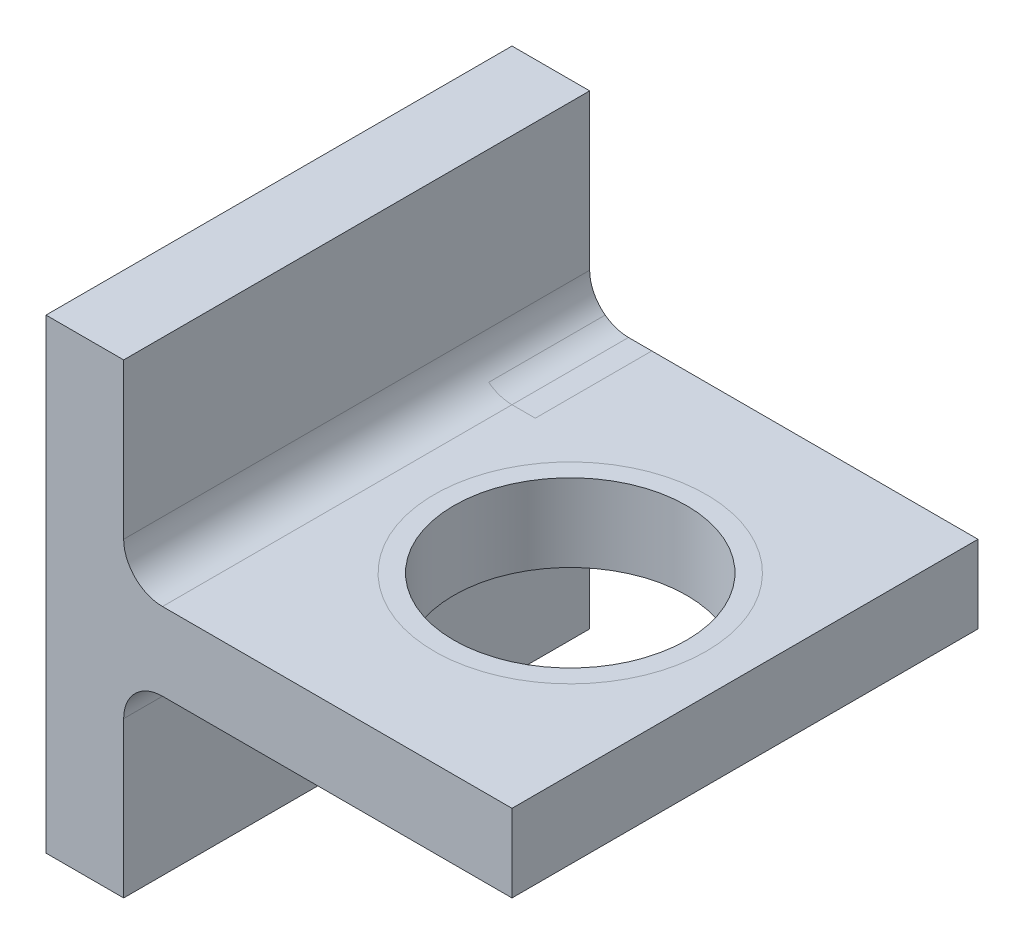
from build123d import *

# Parameters (mm, degrees)
BASE_EXTRUDE_DEPTH  = 60
FILLET1_R           = 10
EXTRUDE1_DEPTH      = 147.969384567
EXTRUDE1_DEPTH_BACK = 147.969384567
SKETCH2_R           = 30


with BuildPart() as part:
    # Sketch1 → Base-Extrude (new, symmetric)
    with BuildSketch(Plane.XY):
        Polygon((0, -60), (20, -60), (20, -10), (120, -10), (120, 10), (20, 10), (20, 60), (0, 60), align=None)
    extrude(amount=BASE_EXTRUDE_DEPTH, both=True)

    # Fillet1
    fillet1_edges = [part.edges().sort_by_distance(p)[0] for p in [
        (20, 10, 0),
        (20, -10, 0),
    ]]
    fillet(fillet1_edges, radius=FILLET1_R)

    # Sketch2 → Extrude1 (cut, two sides: drawn at the far end of the back side and taken through both)
    with BuildSketch(Plane(origin=(0, 0, 0), x_dir=(-1, 0, 0), z_dir=(0, 1, 0)).offset(-EXTRUDE1_DEPTH_BACK)):
        with Locations(Location((-75, 0, 0), (0, 0, 90))):
            Circle(SKETCH2_R)
    extrude(amount=EXTRUDE1_DEPTH + EXTRUDE1_DEPTH_BACK, mode=Mode.SUBTRACT)


solid = part.part
